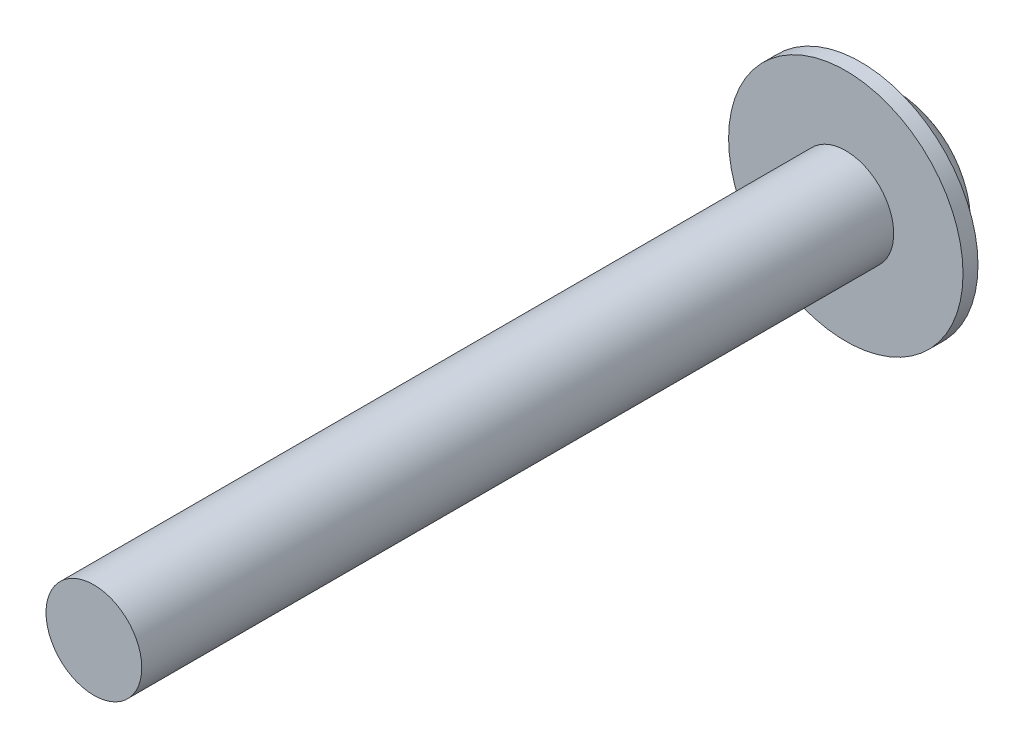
from build123d import *

# Parameters (mm, degrees)
SKETCH1_R      = 1.2192
EXTRUDE1_DEPTH = 19.144
SKETCH2_R      = 2.9845
EXTRUDE2_DEPTH = 0.381
SKETCH3_R      = 2.2479
EXTRUDE3_DEPTH = 1.143
FILLET1_R      = 1.016


with BuildPart() as part:
    # Sketch1 → Extrude1 (new body)
    with BuildSketch(Plane.XY):
        Circle(SKETCH1_R)
    extrude(amount=EXTRUDE1_DEPTH)

    # Sketch2 → Extrude2 (add)
    with BuildSketch(Plane(origin=(0, 0, 0), x_dir=(-1, 0, 0), z_dir=(0, 0, -1))):
        with Locations(Location((0, 0, 0), (0, 0, 180))):
            Circle(SKETCH2_R)
    extrude(amount=EXTRUDE2_DEPTH)

    # Sketch3 → Extrude3 (add)
    with BuildSketch(Plane(origin=(0, 0, -0.381), x_dir=(-1, 0, 0), z_dir=(0, 0, -1))):
        Circle(SKETCH3_R)
    extrude(amount=EXTRUDE3_DEPTH)

    # Fillet1
    fillet1_edges = [part.edges().sort_by_distance(p)[0] for p in [
        (2.2479, 0, -1.524),
    ]]
    fillet(fillet1_edges, radius=FILLET1_R)


solid = part.part
